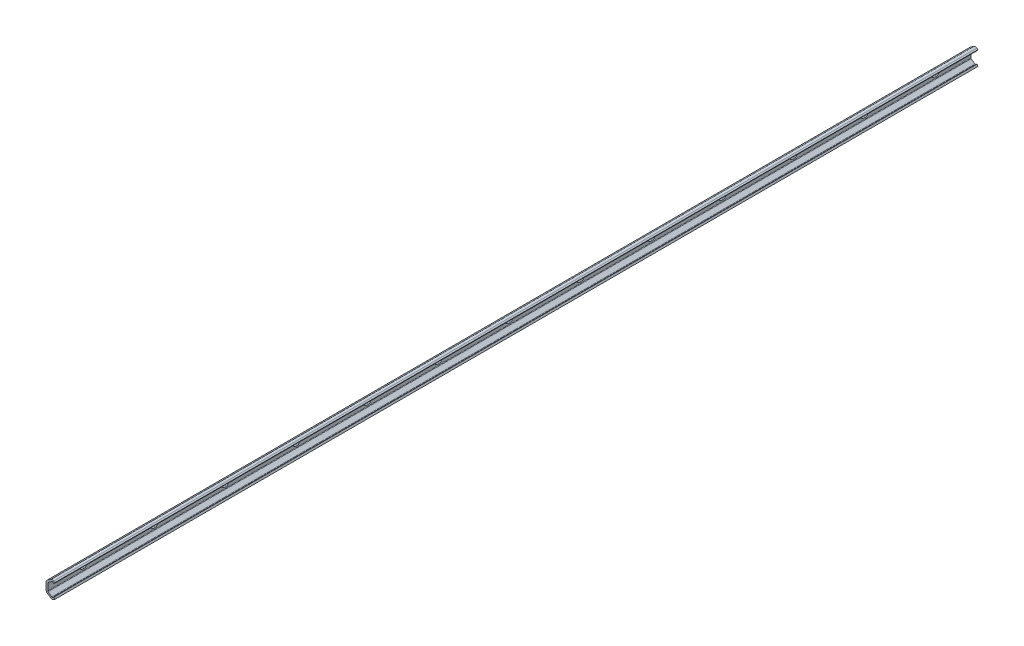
from build123d import *

# Parameters (mm, degrees)
EXTRUDE1_DEPTH  = 1040
EXTRUDE2_DEPTH  = 1041.075368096
LPATTERN1_COUNT = 13
LPATTERN1_PITCH = 80


with BuildPart() as part:
    # Sketch1 → Extrude1 (new body)
    with BuildSketch(Plane.XY):
        with BuildLine():
            Line((8.852847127, 6.521073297), (10, 8.159377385))
            Line((10, 8.159377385), (8.632108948, 9.117185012))
            ThreePointArc((8.632108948, 9.117185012), (7, 9.631786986), (5.367891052, 9.117185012))
            Line((5.367891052, 9.117185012), (1.382718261, 6.326736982))
            ThreePointArc((1.382718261, 6.326736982), (0.396073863, 5.224958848), (0, 3.8))
            Line((0, 3.8), (0, -3.8))
            ThreePointArc((0, -3.8), (0.368285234, -5.240165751), (1.382718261, -6.326736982))
            Line((1.382718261, -6.326736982), (5.367891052, -9.117185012))
            ThreePointArc((5.367891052, -9.117185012), (7, -9.631786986), (8.632108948, -9.117185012))
            Line((8.632108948, -9.117185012), (10, -8.159377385))
            Line((10, -8.159377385), (8.852847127, -6.521073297))
            Line((8.852847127, -6.521073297), (7.521966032, -7.452966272))
            ThreePointArc((7.521966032, -7.452966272), (7, -7.61754153), (6.478033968, -7.452966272))
            Line((6.478033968, -7.452966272), (2.369060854, -4.575832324))
            ThreePointArc((2.369060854, -4.575832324), (2.082184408, -4.236601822), (2, -3.8))
            Line((2, -3.8), (2, 3.8))
            ThreePointArc((2, 3.8), (2.096966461, 4.229570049), (2.369060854, 4.575832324))
            Line((2.369060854, 4.575832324), (6.478033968, 7.452966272))
            ThreePointArc((6.478033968, 7.452966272), (7, 7.61754153), (7.521966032, 7.452966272))
            Line((7.521966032, 7.452966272), (8.852847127, 6.521073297))
        make_face()
    extrude(amount=-EXTRUDE1_DEPTH)

    # Sketch2 → Extrude2 (cut, through all)
    with BuildSketch(Plane(origin=(2, 0, 0), x_dir=(0, 0, -1), z_dir=(1, 0, 0))):
        with BuildLine():
            Line((38.75, 2.25), (41.25, 2.25))
            ThreePointArc((41.25, 2.25), (43.5, 0), (41.25, -2.25))
            Line((41.25, -2.25), (38.75, -2.25))
            ThreePointArc((38.75, -2.25), (36.5, 0), (38.75, 2.25))
        make_face()
    extrude2 = extrude(amount=-EXTRUDE2_DEPTH, mode=Mode.SUBTRACT)

    # LPattern1: Extrude2 ×13
    with Locations(*[(0, 0, -i * LPATTERN1_PITCH) for i in range(1, LPATTERN1_COUNT)]):
        add(extrude2, mode=Mode.SUBTRACT)


solid = part.part
